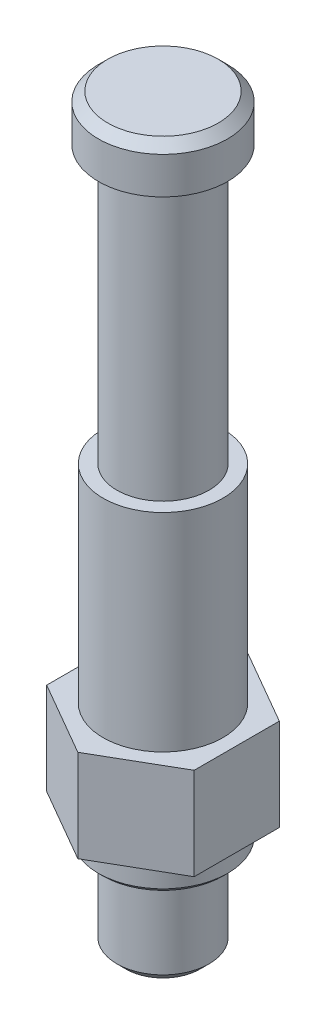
ISO-10303-21;
HEADER;
FILE_DESCRIPTION(('STEP AP214'),'2;1');
FILE_NAME('part.step','',(''),(''),'','','');
FILE_SCHEMA(('AUTOMOTIVE_DESIGN { 1 0 10303 214 1 1 1 1 }'));
ENDSEC;
DATA;
#1=APPLICATION_CONTEXT('core data for automotive mechanical design processes');
#2=APPLICATION_PROTOCOL_DEFINITION('international standard','automotive_design',2000,#1);
#3=PRODUCT_CONTEXT('',#1,'mechanical');
#4=PRODUCT('Part','Part','',(#3));
#5=PRODUCT_RELATED_PRODUCT_CATEGORY('part','',(#4));
#6=PRODUCT_DEFINITION_FORMATION('','',#4);
#7=PRODUCT_DEFINITION_CONTEXT('part definition',#1,'design');
#8=PRODUCT_DEFINITION('design','',#6,#7);
#9=PRODUCT_DEFINITION_SHAPE('','',#8);
#10=(LENGTH_UNIT() NAMED_UNIT(*) SI_UNIT(.MILLI.,.METRE.));
#11=(NAMED_UNIT(*) PLANE_ANGLE_UNIT() SI_UNIT($,.RADIAN.));
#12=(NAMED_UNIT(*) SI_UNIT($,.STERADIAN.) SOLID_ANGLE_UNIT());
#13=UNCERTAINTY_MEASURE_WITH_UNIT(LENGTH_MEASURE(1.E-05),#10,'distance_accuracy_value','');
#14=(GEOMETRIC_REPRESENTATION_CONTEXT(3) GLOBAL_UNCERTAINTY_ASSIGNED_CONTEXT((#13)) GLOBAL_UNIT_ASSIGNED_CONTEXT((#10,
#11,#12)) REPRESENTATION_CONTEXT('',''));
#15=CARTESIAN_POINT('',(0.,0.,0.));
#16=DIRECTION('',(0.,0.,1.));
#17=DIRECTION('',(1.,0.,0.));
#18=AXIS2_PLACEMENT_3D('',#15,#16,#17);
#19=CARTESIAN_POINT('',(0.,80.5,0.));
#20=DIRECTION('',(0.,-1.,0.));
#21=DIRECTION('',(0.,0.,-1.));
#22=AXIS2_PLACEMENT_3D('',#19,#20,#21);
#23=PLANE('',#22);
#24=CARTESIAN_POINT('',(0.,80.5,0.));
#25=DIRECTION('',(0.,-1.,0.));
#26=DIRECTION('',(0.,0.,-1.));
#27=AXIS2_PLACEMENT_3D('',#24,#25,#26);
#28=CIRCLE('',#27,6.);
#29=CARTESIAN_POINT('',(0.,80.5,-6.));
#30=VERTEX_POINT('',#29);
#31=EDGE_CURVE('E149',#30,#30,#28,.F.);
#32=ORIENTED_EDGE('',*,*,#31,.T.);
#33=EDGE_LOOP('',(#32));
#34=FACE_BOUND('',#33,.T.);
#35=ADVANCED_FACE('F34',(#34),#23,.F.);
#36=CARTESIAN_POINT('',(0.,0.,0.));
#37=DIRECTION('',(0.,-1.,0.));
#38=DIRECTION('',(0.,0.,-1.));
#39=AXIS2_PLACEMENT_3D('',#36,#37,#38);
#40=CYLINDRICAL_SURFACE('',#39,7.);
#41=CARTESIAN_POINT('',(0.,79.5,0.));
#42=DIRECTION('',(0.,-1.,0.));
#43=DIRECTION('',(0.,0.,-1.));
#44=AXIS2_PLACEMENT_3D('',#41,#42,#43);
#45=CIRCLE('',#44,7.);
#46=CARTESIAN_POINT('',(0.,79.5,-7.));
#47=VERTEX_POINT('',#46);
#48=EDGE_CURVE('E146',#47,#47,#45,.T.);
#49=ORIENTED_EDGE('',*,*,#48,.T.);
#50=EDGE_LOOP('',(#49));
#51=FACE_BOUND('',#50,.T.);
#52=CARTESIAN_POINT('',(0.,75.5,0.));
#53=DIRECTION('',(0.,-1.,0.));
#54=DIRECTION('',(0.,0.,-1.));
#55=AXIS2_PLACEMENT_3D('',#52,#53,#54);
#56=CIRCLE('',#55,7.);
#57=CARTESIAN_POINT('',(0.,75.5,-7.));
#58=VERTEX_POINT('',#57);
#59=EDGE_CURVE('E137',#58,#58,#56,.T.);
#60=ORIENTED_EDGE('',*,*,#59,.F.);
#61=EDGE_LOOP('',(#60));
#62=FACE_BOUND('',#61,.T.);
#63=ADVANCED_FACE('F200',(#51,#62),#40,.T.);
#64=CARTESIAN_POINT('',(-7.,75.5,0.));
#65=DIRECTION('',(0.,1.,0.));
#66=DIRECTION('',(0.,0.,1.));
#67=AXIS2_PLACEMENT_3D('',#64,#65,#66);
#68=PLANE('',#67);
#69=CARTESIAN_POINT('',(0.,75.5,0.));
#70=DIRECTION('',(0.,-1.,0.));
#71=DIRECTION('',(0.,0.,-1.));
#72=AXIS2_PLACEMENT_3D('',#69,#70,#71);
#73=CIRCLE('',#72,5.);
#74=CARTESIAN_POINT('',(0.,75.5,-5.));
#75=VERTEX_POINT('',#74);
#76=EDGE_CURVE('E134',#75,#75,#73,.T.);
#77=ORIENTED_EDGE('',*,*,#76,.F.);
#78=EDGE_LOOP('',(#77));
#79=FACE_BOUND('',#78,.T.);
#80=ORIENTED_EDGE('',*,*,#59,.T.);
#81=EDGE_LOOP('',(#80));
#82=FACE_BOUND('',#81,.T.);
#83=ADVANCED_FACE('F206',(#79,#82),#68,.F.);
#84=CARTESIAN_POINT('',(0.,0.,0.));
#85=DIRECTION('',(0.,-1.,0.));
#86=DIRECTION('',(0.,0.,-1.));
#87=AXIS2_PLACEMENT_3D('',#84,#85,#86);
#88=CYLINDRICAL_SURFACE('',#87,5.);
#89=CARTESIAN_POINT('',(0.,45.5,0.));
#90=DIRECTION('',(0.,-1.,0.));
#91=DIRECTION('',(0.,0.,-1.));
#92=AXIS2_PLACEMENT_3D('',#89,#90,#91);
#93=CIRCLE('',#92,4.99999999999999);
#94=CARTESIAN_POINT('',(0.,45.5,-4.99999999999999));
#95=VERTEX_POINT('',#94);
#96=EDGE_CURVE('E131',#95,#95,#93,.T.);
#97=ORIENTED_EDGE('',*,*,#96,.F.);
#98=EDGE_LOOP('',(#97));
#99=FACE_BOUND('',#98,.T.);
#100=ORIENTED_EDGE('',*,*,#76,.T.);
#101=EDGE_LOOP('',(#100));
#102=FACE_BOUND('',#101,.T.);
#103=ADVANCED_FACE('F226',(#99,#102),#88,.T.);
#104=CARTESIAN_POINT('',(-4.99999999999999,45.5,0.));
#105=DIRECTION('',(0.,-1.,0.));
#106=DIRECTION('',(0.,0.,-1.));
#107=AXIS2_PLACEMENT_3D('',#104,#105,#106);
#108=PLANE('',#107);
#109=CARTESIAN_POINT('',(0.,45.5,0.));
#110=DIRECTION('',(0.,-1.,0.));
#111=DIRECTION('',(0.,0.,-1.));
#112=AXIS2_PLACEMENT_3D('',#109,#110,#111);
#113=CIRCLE('',#112,6.5);
#114=CARTESIAN_POINT('',(0.,45.5,-6.5));
#115=VERTEX_POINT('',#114);
#116=EDGE_CURVE('E128',#115,#115,#113,.T.);
#117=ORIENTED_EDGE('',*,*,#116,.F.);
#118=EDGE_LOOP('',(#117));
#119=FACE_BOUND('',#118,.T.);
#120=ORIENTED_EDGE('',*,*,#96,.T.);
#121=EDGE_LOOP('',(#120));
#122=FACE_BOUND('',#121,.T.);
#123=ADVANCED_FACE('F231',(#119,#122),#108,.F.);
#124=CARTESIAN_POINT('',(0.,0.,0.));
#125=DIRECTION('',(0.,-1.,0.));
#126=DIRECTION('',(0.,0.,-1.));
#127=AXIS2_PLACEMENT_3D('',#124,#125,#126);
#128=CYLINDRICAL_SURFACE('',#127,6.5);
#129=CARTESIAN_POINT('',(0.,23.,0.));
#130=DIRECTION('',(0.,-1.,0.));
#131=DIRECTION('',(0.,0.,-1.));
#132=AXIS2_PLACEMENT_3D('',#129,#130,#131);
#133=CIRCLE('',#132,6.49999999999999);
#134=CARTESIAN_POINT('',(0.,23.,-6.49999999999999));
#135=VERTEX_POINT('',#134);
#136=EDGE_CURVE('E125',#135,#135,#133,.T.);
#137=ORIENTED_EDGE('',*,*,#136,.F.);
#138=EDGE_LOOP('',(#137));
#139=FACE_BOUND('',#138,.T.);
#140=ORIENTED_EDGE('',*,*,#116,.T.);
#141=EDGE_LOOP('',(#140));
#142=FACE_BOUND('',#141,.T.);
#143=ADVANCED_FACE('F238',(#139,#142),#128,.T.);
#144=CARTESIAN_POINT('',(-6.49999999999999,23.,0.));
#145=DIRECTION('',(0.,-1.,0.));
#146=DIRECTION('',(0.,0.,-1.));
#147=AXIS2_PLACEMENT_3D('',#144,#145,#146);
#148=PLANE('',#147);
#149=DIRECTION('',(-0.866025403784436,0.,-0.500000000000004));
#150=VECTOR('',#149,1.);
#151=CARTESIAN_POINT('',(-0.874999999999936,23.,-9.74278579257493));
#152=LINE('',#151,#150);
#153=CARTESIAN_POINT('',(8.,23.,-4.61880215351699));
#154=VERTEX_POINT('',#153);
#155=CARTESIAN_POINT('',(0.,23.,-9.23760430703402));
#156=VERTEX_POINT('',#155);
#157=EDGE_CURVE('E115',#154,#156,#152,.T.);
#158=ORIENTED_EDGE('',*,*,#157,.T.);
#159=DIRECTION('',(-0.86602540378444,0.,0.499999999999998));
#160=VECTOR('',#159,1.);
#161=CARTESIAN_POINT('',(-8.87499999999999,23.,-4.11362066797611));
#162=LINE('',#161,#160);
#163=CARTESIAN_POINT('',(-8.,23.,-4.61880215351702));
#164=VERTEX_POINT('',#163);
#165=EDGE_CURVE('E108',#156,#164,#162,.T.);
#166=ORIENTED_EDGE('',*,*,#165,.T.);
#167=DIRECTION('',(0.,0.,1.));
#168=VECTOR('',#167,1.);
#169=CARTESIAN_POINT('',(-8.,23.,0.));
#170=LINE('',#169,#168);
#171=CARTESIAN_POINT('',(-8.,23.,4.61880215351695));
#172=VERTEX_POINT('',#171);
#173=EDGE_CURVE('E92',#164,#172,#170,.T.);
#174=ORIENTED_EDGE('',*,*,#173,.T.);
#175=DIRECTION('',(0.866025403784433,0.,0.50000000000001));
#176=VECTOR('',#175,1.);
#177=CARTESIAN_POINT('',(-8.87500000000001,23.,4.113620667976));
#178=LINE('',#177,#176);
#179=CARTESIAN_POINT('',(0.,23.,9.23760430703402));
#180=VERTEX_POINT('',#179);
#181=EDGE_CURVE('E49',#172,#180,#178,.T.);
#182=ORIENTED_EDGE('',*,*,#181,.T.);
#183=DIRECTION('',(0.866025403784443,0.,-0.499999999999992));
#184=VECTOR('',#183,1.);
#185=CARTESIAN_POINT('',(-0.875000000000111,23.,9.74278579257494));
#186=LINE('',#185,#184);
#187=CARTESIAN_POINT('',(8.,23.,4.61880215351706));
#188=VERTEX_POINT('',#187);
#189=EDGE_CURVE('E86',#180,#188,#186,.T.);
#190=ORIENTED_EDGE('',*,*,#189,.T.);
#191=DIRECTION('',(0.,0.,-1.));
#192=VECTOR('',#191,1.);
#193=CARTESIAN_POINT('',(8.,23.,0.));
#194=LINE('',#193,#192);
#195=EDGE_CURVE('E93',#188,#154,#194,.T.);
#196=ORIENTED_EDGE('',*,*,#195,.T.);
#197=EDGE_LOOP('',(#158,#166,#174,#182,#190,#196));
#198=FACE_BOUND('',#197,.T.);
#199=ORIENTED_EDGE('',*,*,#136,.T.);
#200=EDGE_LOOP('',(#199));
#201=FACE_BOUND('',#200,.T.);
#202=ADVANCED_FACE('F101',(#198,#201),#148,.F.);
#203=CARTESIAN_POINT('',(-10.,13.,0.));
#204=DIRECTION('',(0.,1.,0.));
#205=DIRECTION('',(0.,0.,1.));
#206=AXIS2_PLACEMENT_3D('',#203,#204,#205);
#207=PLANE('',#206);
#208=DIRECTION('',(0.,0.,-1.));
#209=VECTOR('',#208,1.);
#210=CARTESIAN_POINT('',(-8.,13.,0.));
#211=LINE('',#210,#209);
#212=CARTESIAN_POINT('',(-8.,13.,4.61880215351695));
#213=VERTEX_POINT('',#212);
#214=CARTESIAN_POINT('',(-8.,13.,-4.61880215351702));
#215=VERTEX_POINT('',#214);
#216=EDGE_CURVE('E158',#213,#215,#211,.T.);
#217=ORIENTED_EDGE('',*,*,#216,.T.);
#218=DIRECTION('',(0.86602540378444,0.,-0.499999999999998));
#219=VECTOR('',#218,1.);
#220=CARTESIAN_POINT('',(-11.5,13.,-2.59807621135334));
#221=LINE('',#220,#219);
#222=CARTESIAN_POINT('',(0.,13.,-9.23760430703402));
#223=VERTEX_POINT('',#222);
#224=EDGE_CURVE('E105',#215,#223,#221,.T.);
#225=ORIENTED_EDGE('',*,*,#224,.T.);
#226=DIRECTION('',(0.866025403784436,0.,0.500000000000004));
#227=VECTOR('',#226,1.);
#228=CARTESIAN_POINT('',(-3.49999999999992,13.,-11.2583302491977));
#229=LINE('',#228,#227);
#230=CARTESIAN_POINT('',(8.,13.,-4.61880215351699));
#231=VERTEX_POINT('',#230);
#232=EDGE_CURVE('E166',#223,#231,#229,.T.);
#233=ORIENTED_EDGE('',*,*,#232,.T.);
#234=DIRECTION('',(0.,0.,1.));
#235=VECTOR('',#234,1.);
#236=CARTESIAN_POINT('',(8.,13.,0.));
#237=LINE('',#236,#235);
#238=CARTESIAN_POINT('',(8.,13.,4.61880215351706));
#239=VERTEX_POINT('',#238);
#240=EDGE_CURVE('E42',#231,#239,#237,.T.);
#241=ORIENTED_EDGE('',*,*,#240,.T.);
#242=DIRECTION('',(-0.866025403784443,0.,0.499999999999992));
#243=VECTOR('',#242,1.);
#244=CARTESIAN_POINT('',(-3.50000000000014,13.,11.2583302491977));
#245=LINE('',#244,#243);
#246=CARTESIAN_POINT('',(0.,13.,9.23760430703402));
#247=VERTEX_POINT('',#246);
#248=EDGE_CURVE('E11',#239,#247,#245,.T.);
#249=ORIENTED_EDGE('',*,*,#248,.T.);
#250=DIRECTION('',(-0.866025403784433,0.,-0.50000000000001));
#251=VECTOR('',#250,1.);
#252=CARTESIAN_POINT('',(-11.5,13.,2.59807621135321));
#253=LINE('',#252,#251);
#254=EDGE_CURVE('E97',#247,#213,#253,.T.);
#255=ORIENTED_EDGE('',*,*,#254,.T.);
#256=EDGE_LOOP('',(#217,#225,#233,#241,#249,#255));
#257=FACE_BOUND('',#256,.T.);
#258=CARTESIAN_POINT('',(0.,13.,0.));
#259=DIRECTION('',(0.,-1.,0.));
#260=DIRECTION('',(0.,0.,-1.));
#261=AXIS2_PLACEMENT_3D('',#258,#259,#260);
#262=CIRCLE('',#261,7.);
#263=CARTESIAN_POINT('',(0.,13.,-7.));
#264=VERTEX_POINT('',#263);
#265=EDGE_CURVE('E122',#264,#264,#262,.T.);
#266=ORIENTED_EDGE('',*,*,#265,.F.);
#267=EDGE_LOOP('',(#266));
#268=FACE_BOUND('',#267,.T.);
#269=ADVANCED_FACE('F170',(#257,#268),#207,.F.);
#270=CARTESIAN_POINT('',(0.,0.,0.));
#271=DIRECTION('',(0.,-1.,0.));
#272=DIRECTION('',(0.,0.,-1.));
#273=AXIS2_PLACEMENT_3D('',#270,#271,#272);
#274=CYLINDRICAL_SURFACE('',#273,7.);
#275=CARTESIAN_POINT('',(0.,10.5,0.));
#276=DIRECTION('',(0.,1.,0.));
#277=DIRECTION('',(0.,0.,1.));
#278=AXIS2_PLACEMENT_3D('',#275,#276,#277);
#279=CIRCLE('',#278,7.);
#280=CARTESIAN_POINT('',(0.,10.5,7.));
#281=VERTEX_POINT('',#280);
#282=EDGE_CURVE('E155',#281,#281,#279,.T.);
#283=ORIENTED_EDGE('',*,*,#282,.T.);
#284=EDGE_LOOP('',(#283));
#285=FACE_BOUND('',#284,.T.);
#286=ORIENTED_EDGE('',*,*,#265,.T.);
#287=EDGE_LOOP('',(#286));
#288=FACE_BOUND('',#287,.T.);
#289=ADVANCED_FACE('F247',(#285,#288),#274,.T.);
#290=CARTESIAN_POINT('',(-7.,10.,0.));
#291=DIRECTION('',(0.,1.,0.));
#292=DIRECTION('',(0.,0.,1.));
#293=AXIS2_PLACEMENT_3D('',#290,#291,#292);
#294=PLANE('',#293);
#295=CARTESIAN_POINT('',(0.,10.,0.));
#296=DIRECTION('',(0.,1.,0.));
#297=DIRECTION('',(0.,0.,1.));
#298=AXIS2_PLACEMENT_3D('',#295,#296,#297);
#299=CIRCLE('',#298,6.50000000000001);
#300=CARTESIAN_POINT('',(0.,10.,6.50000000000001));
#301=VERTEX_POINT('',#300);
#302=EDGE_CURVE('E152',#301,#301,#299,.F.);
#303=ORIENTED_EDGE('',*,*,#302,.T.);
#304=EDGE_LOOP('',(#303));
#305=FACE_BOUND('',#304,.T.);
#306=CARTESIAN_POINT('',(0.,10.,0.));
#307=DIRECTION('',(0.,-1.,0.));
#308=DIRECTION('',(0.,0.,-1.));
#309=AXIS2_PLACEMENT_3D('',#306,#307,#308);
#310=CIRCLE('',#309,5.);
#311=CARTESIAN_POINT('',(0.,10.,-5.));
#312=VERTEX_POINT('',#311);
#313=EDGE_CURVE('E119',#312,#312,#310,.T.);
#314=ORIENTED_EDGE('',*,*,#313,.F.);
#315=EDGE_LOOP('',(#314));
#316=FACE_BOUND('',#315,.T.);
#317=ADVANCED_FACE('F250',(#305,#316),#294,.F.);
#318=CARTESIAN_POINT('',(0.,0.,0.));
#319=DIRECTION('',(0.,-1.,0.));
#320=DIRECTION('',(0.,0.,-1.));
#321=AXIS2_PLACEMENT_3D('',#318,#319,#320);
#322=CYLINDRICAL_SURFACE('',#321,5.);
#323=CARTESIAN_POINT('',(0.,0.999999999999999,0.));
#324=DIRECTION('',(0.,1.,0.));
#325=DIRECTION('',(0.,0.,1.));
#326=AXIS2_PLACEMENT_3D('',#323,#324,#325);
#327=CIRCLE('',#326,5.);
#328=CARTESIAN_POINT('',(0.,0.999999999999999,5.));
#329=VERTEX_POINT('',#328);
#330=EDGE_CURVE('E143',#329,#329,#327,.T.);
#331=ORIENTED_EDGE('',*,*,#330,.T.);
#332=EDGE_LOOP('',(#331));
#333=FACE_BOUND('',#332,.T.);
#334=ORIENTED_EDGE('',*,*,#313,.T.);
#335=EDGE_LOOP('',(#334));
#336=FACE_BOUND('',#335,.T.);
#337=ADVANCED_FACE('F254',(#333,#336),#322,.T.);
#338=CARTESIAN_POINT('',(-5.,0.,0.));
#339=DIRECTION('',(0.,1.,0.));
#340=DIRECTION('',(0.,0.,1.));
#341=AXIS2_PLACEMENT_3D('',#338,#339,#340);
#342=PLANE('',#341);
#343=CARTESIAN_POINT('',(0.,0.,0.));
#344=DIRECTION('',(0.,1.,0.));
#345=DIRECTION('',(0.,0.,1.));
#346=AXIS2_PLACEMENT_3D('',#343,#344,#345);
#347=CIRCLE('',#346,3.99999999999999);
#348=CARTESIAN_POINT('',(0.,0.,3.99999999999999));
#349=VERTEX_POINT('',#348);
#350=EDGE_CURVE('E140',#349,#349,#347,.F.);
#351=ORIENTED_EDGE('',*,*,#350,.T.);
#352=EDGE_LOOP('',(#351));
#353=FACE_BOUND('',#352,.T.);
#354=ADVANCED_FACE('F213',(#353),#342,.F.);
#355=CARTESIAN_POINT('',(0.,0.,0.));
#356=DIRECTION('',(0.,1.,0.));
#357=DIRECTION('',(0.,0.,1.));
#358=AXIS2_PLACEMENT_3D('',#355,#356,#357);
#359=CONICAL_SURFACE('',#358,3.99999999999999,0.785398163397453);
#360=ORIENTED_EDGE('',*,*,#330,.F.);
#361=EDGE_LOOP('',(#360));
#362=FACE_BOUND('',#361,.T.);
#363=ORIENTED_EDGE('',*,*,#350,.F.);
#364=EDGE_LOOP('',(#363));
#365=FACE_BOUND('',#364,.T.);
#366=ADVANCED_FACE('F211',(#362,#365),#359,.T.);
#367=CARTESIAN_POINT('',(0.,79.5,0.));
#368=DIRECTION('',(0.,-1.,0.));
#369=DIRECTION('',(0.,0.,-1.));
#370=AXIS2_PLACEMENT_3D('',#367,#368,#369);
#371=CONICAL_SURFACE('',#370,7.,0.785398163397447);
#372=ORIENTED_EDGE('',*,*,#31,.F.);
#373=EDGE_LOOP('',(#372));
#374=FACE_BOUND('',#373,.T.);
#375=ORIENTED_EDGE('',*,*,#48,.F.);
#376=EDGE_LOOP('',(#375));
#377=FACE_BOUND('',#376,.T.);
#378=ADVANCED_FACE('F195',(#374,#377),#371,.T.);
#379=CARTESIAN_POINT('',(0.,10.,0.));
#380=DIRECTION('',(0.,1.,0.));
#381=DIRECTION('',(0.,0.,1.));
#382=AXIS2_PLACEMENT_3D('',#379,#380,#381);
#383=CONICAL_SURFACE('',#382,6.50000000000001,0.785398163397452);
#384=ORIENTED_EDGE('',*,*,#282,.F.);
#385=EDGE_LOOP('',(#384));
#386=FACE_BOUND('',#385,.T.);
#387=ORIENTED_EDGE('',*,*,#302,.F.);
#388=EDGE_LOOP('',(#387));
#389=FACE_BOUND('',#388,.T.);
#390=ADVANCED_FACE('F36',(#386,#389),#383,.T.);
#391=CARTESIAN_POINT('',(-8.,33.9017148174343,-10.));
#392=DIRECTION('',(1.,0.,0.));
#393=DIRECTION('',(0.,0.,-1.));
#394=AXIS2_PLACEMENT_3D('',#391,#392,#393);
#395=PLANE('',#394);
#396=ORIENTED_EDGE('',*,*,#173,.F.);
#397=DIRECTION('',(0.,-1.,0.));
#398=VECTOR('',#397,1.);
#399=CARTESIAN_POINT('',(-8.,33.9017148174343,-4.61880215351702));
#400=LINE('',#399,#398);
#401=EDGE_CURVE('E163',#164,#215,#400,.T.);
#402=ORIENTED_EDGE('',*,*,#401,.T.);
#403=ORIENTED_EDGE('',*,*,#216,.F.);
#404=DIRECTION('',(0.,1.,0.));
#405=VECTOR('',#404,1.);
#406=CARTESIAN_POINT('',(-8.,33.9017148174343,4.61880215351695));
#407=LINE('',#406,#405);
#408=EDGE_CURVE('E161',#213,#172,#407,.T.);
#409=ORIENTED_EDGE('',*,*,#408,.T.);
#410=EDGE_LOOP('',(#396,#402,#403,#409));
#411=FACE_BOUND('',#410,.T.);
#412=ADVANCED_FACE('F187',(#411),#395,.F.);
#413=CARTESIAN_POINT('',(-6.33012701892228,33.9017148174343,12.8923048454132));
#414=DIRECTION('',(-0.499999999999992,0.,-0.866025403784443));
#415=DIRECTION('',(-0.866025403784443,0.,0.499999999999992));
#416=AXIS2_PLACEMENT_3D('',#413,#414,#415);
#417=PLANE('',#416);
#418=DIRECTION('',(0.,-1.,0.));
#419=VECTOR('',#418,1.);
#420=CARTESIAN_POINT('',(0.,33.9017148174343,9.23760430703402));
#421=LINE('',#420,#419);
#422=EDGE_CURVE('E88',#180,#247,#421,.T.);
#423=ORIENTED_EDGE('',*,*,#422,.T.);
#424=ORIENTED_EDGE('',*,*,#248,.F.);
#425=DIRECTION('',(0.,-1.,0.));
#426=VECTOR('',#425,1.);
#427=CARTESIAN_POINT('',(8.,33.9017148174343,4.61880215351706));
#428=LINE('',#427,#426);
#429=EDGE_CURVE('E89',#188,#239,#428,.T.);
#430=ORIENTED_EDGE('',*,*,#429,.F.);
#431=ORIENTED_EDGE('',*,*,#189,.F.);
#432=EDGE_LOOP('',(#423,#424,#430,#431));
#433=FACE_BOUND('',#432,.T.);
#434=ADVANCED_FACE('F87',(#433),#417,.F.);
#435=CARTESIAN_POINT('',(8.,33.9017148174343,10.));
#436=DIRECTION('',(-1.,0.,0.));
#437=DIRECTION('',(0.,0.,1.));
#438=AXIS2_PLACEMENT_3D('',#435,#436,#437);
#439=PLANE('',#438);
#440=ORIENTED_EDGE('',*,*,#429,.T.);
#441=ORIENTED_EDGE('',*,*,#240,.F.);
#442=DIRECTION('',(0.,-1.,0.));
#443=VECTOR('',#442,1.);
#444=CARTESIAN_POINT('',(8.,33.9017148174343,-4.61880215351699));
#445=LINE('',#444,#443);
#446=EDGE_CURVE('E176',#154,#231,#445,.T.);
#447=ORIENTED_EDGE('',*,*,#446,.F.);
#448=ORIENTED_EDGE('',*,*,#195,.F.);
#449=EDGE_LOOP('',(#440,#441,#447,#448));
#450=FACE_BOUND('',#449,.T.);
#451=ADVANCED_FACE('F175',(#450),#439,.F.);
#452=CARTESIAN_POINT('',(15.8301270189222,33.9017148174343,-0.0980762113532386));
#453=DIRECTION('',(-0.500000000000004,0.,0.866025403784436));
#454=DIRECTION('',(0.866025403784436,0.,0.500000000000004));
#455=AXIS2_PLACEMENT_3D('',#452,#453,#454);
#456=PLANE('',#455);
#457=ORIENTED_EDGE('',*,*,#446,.T.);
#458=ORIENTED_EDGE('',*,*,#232,.F.);
#459=DIRECTION('',(0.,-1.,0.));
#460=VECTOR('',#459,1.);
#461=CARTESIAN_POINT('',(0.,33.9017148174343,-9.23760430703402));
#462=LINE('',#461,#460);
#463=EDGE_CURVE('E110',#156,#223,#462,.T.);
#464=ORIENTED_EDGE('',*,*,#463,.F.);
#465=ORIENTED_EDGE('',*,*,#157,.F.);
#466=EDGE_LOOP('',(#457,#458,#464,#465));
#467=FACE_BOUND('',#466,.T.);
#468=ADVANCED_FACE('F178',(#467),#456,.F.);
#469=CARTESIAN_POINT('',(7.83012701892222,33.9017148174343,-13.7583302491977));
#470=DIRECTION('',(0.499999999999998,0.,0.86602540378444));
#471=DIRECTION('',(0.86602540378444,0.,-0.499999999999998));
#472=AXIS2_PLACEMENT_3D('',#469,#470,#471);
#473=PLANE('',#472);
#474=ORIENTED_EDGE('',*,*,#463,.T.);
#475=ORIENTED_EDGE('',*,*,#224,.F.);
#476=ORIENTED_EDGE('',*,*,#401,.F.);
#477=ORIENTED_EDGE('',*,*,#165,.F.);
#478=EDGE_LOOP('',(#474,#475,#476,#477));
#479=FACE_BOUND('',#478,.T.);
#480=ADVANCED_FACE('F184',(#479),#473,.F.);
#481=CARTESIAN_POINT('',(-14.3301270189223,33.9017148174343,0.964101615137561));
#482=DIRECTION('',(0.50000000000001,0.,-0.866025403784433));
#483=DIRECTION('',(-0.866025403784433,0.,-0.50000000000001));
#484=AXIS2_PLACEMENT_3D('',#481,#482,#483);
#485=PLANE('',#484);
#486=ORIENTED_EDGE('',*,*,#408,.F.);
#487=ORIENTED_EDGE('',*,*,#254,.F.);
#488=ORIENTED_EDGE('',*,*,#422,.F.);
#489=ORIENTED_EDGE('',*,*,#181,.F.);
#490=EDGE_LOOP('',(#486,#487,#488,#489));
#491=FACE_BOUND('',#490,.T.);
#492=ADVANCED_FACE('F95',(#491),#485,.F.);
#493=CLOSED_SHELL('',(#35,#63,#83,#103,#123,#143,#202,#269,#289,#317,#337,#354,#366,#378,#390,
#412,#434,#451,#468,#480,#492));
#494=MANIFOLD_SOLID_BREP('B2',#493);
#495=ADVANCED_BREP_SHAPE_REPRESENTATION('',(#18,#494),#14);
#496=SHAPE_DEFINITION_REPRESENTATION(#9,#495);
ENDSEC;
END-ISO-10303-21;
